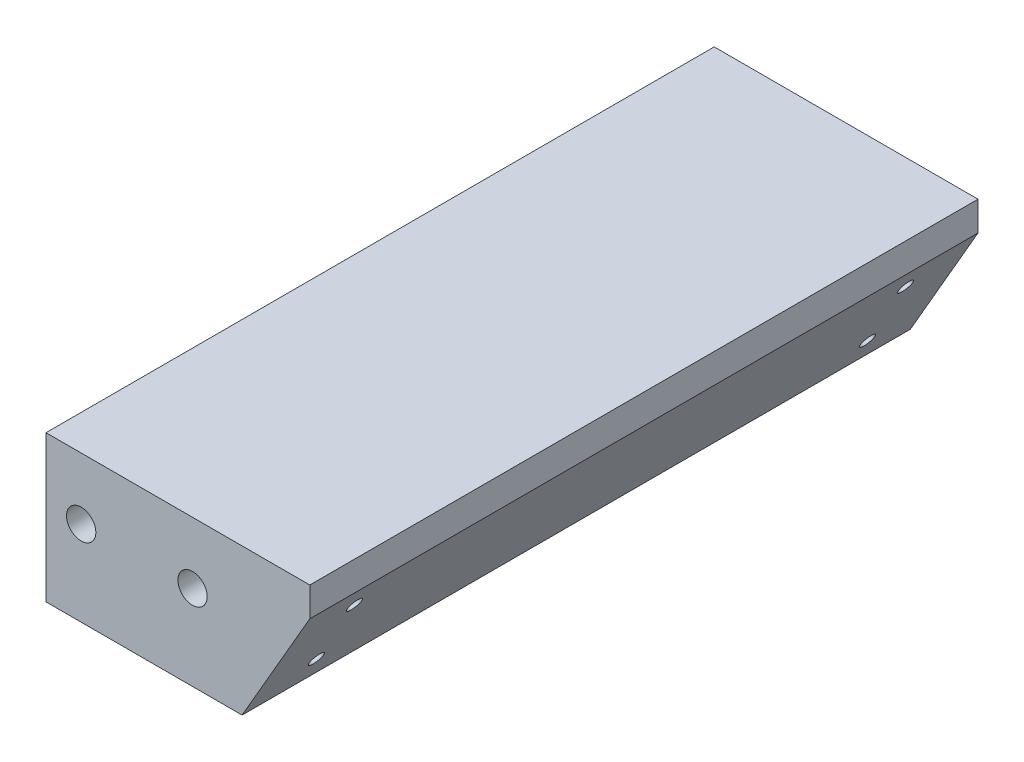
from build123d import *

# Parameters (mm, degrees)
BOSS_EXTRUDE1_DEPTH            = 57
M6X1_0_TAPPED_HOLE1_AT_2_COUNT = 2
M6X1_0_TAPPED_HOLE1_AT_2_PITCH = 19
M3X0_5_TAPPED_HOLE1_D          = 2.5
M3X0_5_TAPPED_HOLE1_DEPTH      = 12
M3X0_5_TAPPED_HOLE1_TIP        = 0.751075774


with BuildPart() as part:
    # Sketch1 → Boss-Extrude1 (new, symmetric)
    with BuildSketch(Plane.XY):
        Polygon((0, 0), (0, -25), (33.452994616, -25), (45, -5), (45, 0), align=None)
    extrude(amount=BOSS_EXTRUDE1_DEPTH, both=True)

    # Sketch2 → M6x1.0 Tapped Hole1 (revolve, cut)
    with BuildSketch(Plane(origin=(25, -10.5, 57), x_dir=(0, -1, 0), z_dir=(1, 0, 0))):
        Polygon((0, 0), (0, 16.502151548), (2.5, 15), (2.5, 0), align=None)
    m6x1_0_tapped_hole1 = revolve(axis=Axis((25, -10.5, 63.35), (0, 0, -1)), mode=Mode.SUBTRACT)

    # M6x1.0 Tapped Hole1 at 2: M6x1.0 Tapped Hole1 ×2
    with Locations(*[(-i * M6X1_0_TAPPED_HOLE1_AT_2_PITCH, 0, 0) for i in range(1, M6X1_0_TAPPED_HOLE1_AT_2_COUNT)]):
        add(m6x1_0_tapped_hole1, mode=Mode.SUBTRACT)

    # Mirror1: M6x1.0 Tapped Hole1 across plane
    add(m6x1_0_tapped_hole1.mirror(Plane.XY), mode=Mode.SUBTRACT)

    # Mirror1 copy 1 sketch → Mirror1 copy 1 (revolve, cut)
    with BuildSketch(Plane(origin=(6, -10.5, -57), x_dir=(0, -1, 0), z_dir=(1, 0, 0))):
        Polygon((0, 0), (0, -16.502151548), (2.5, -15), (2.5, 0), align=None)
    revolve(axis=Axis((6, -10.5, -63.35), (0, 0, -1)), mode=Mode.SUBTRACT)

    # M3x0.5 Tapped Hole1
    with Locations(Plane(origin=(35.915063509, -20.735571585, 0), x_dir=(0, 0, -1), z_dir=(0.86602540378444, -0.4999999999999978, 0))):
        with Locations((-47, 13.407477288), (47, 13.407477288), (47, 0.428893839), (-47, 0.428893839)):
            Hole(M3X0_5_TAPPED_HOLE1_D / 2, depth=M3X0_5_TAPPED_HOLE1_DEPTH)
            with Locations((0, 0, -(M3X0_5_TAPPED_HOLE1_DEPTH + M3X0_5_TAPPED_HOLE1_TIP / 2))):  # 118° drill point
                Cone(0, M3X0_5_TAPPED_HOLE1_D / 2, M3X0_5_TAPPED_HOLE1_TIP, mode=Mode.SUBTRACT)


solid = part.part
